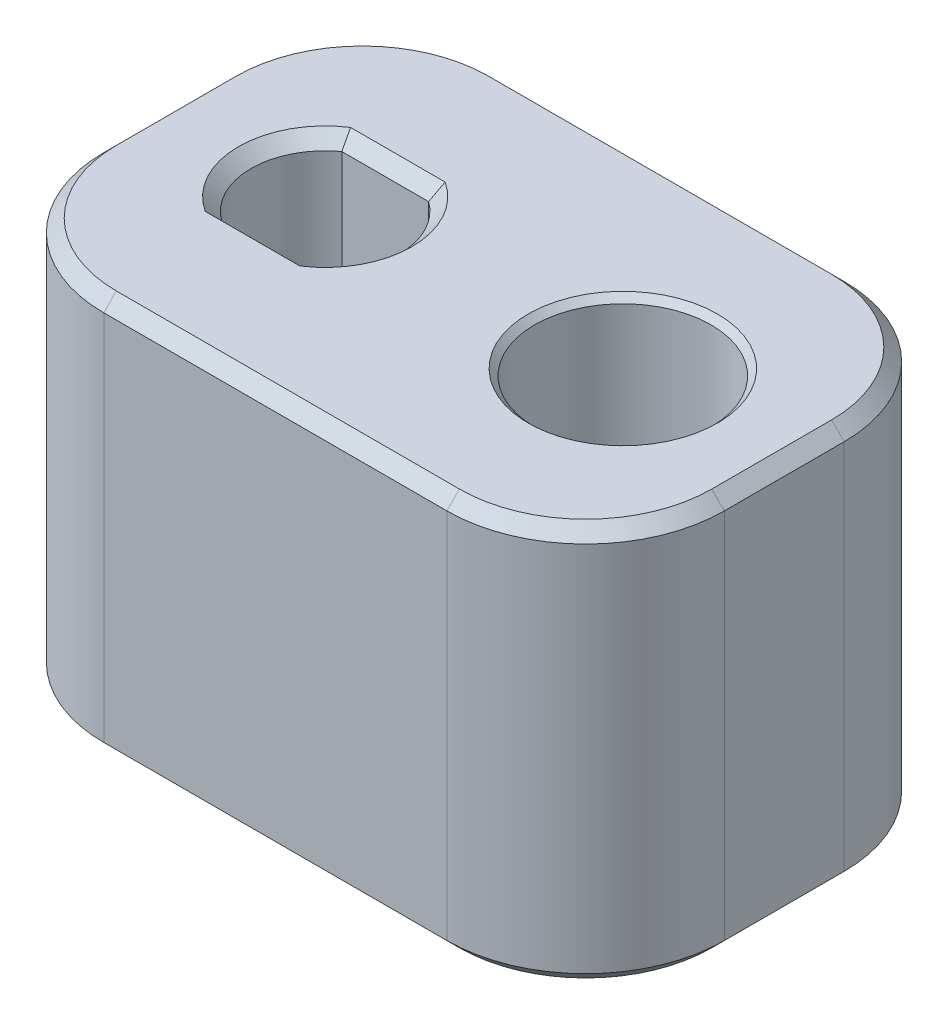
from build123d import *

# Parameters (mm, degrees)
SKETCH1_W      = 24.9936
SKETCH1_H      = 16.002
EXTRUDE1_DEPTH = 16.002
FILLET1_R      = 5.588
EXTRUDE2_DEPTH = 22.823153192
CHAMFER2_SIZE  = 0.508
CHAMFER1_SIZE  = 0.508


with BuildPart() as part:
    # Sketch1 → Extrude1 (new body)
    with BuildSketch(Plane(origin=(0, 0, 0), x_dir=(1, 0, 0), z_dir=(0, 1, 0))):
        Rectangle(SKETCH1_W, SKETCH1_H)
    extrude(amount=EXTRUDE1_DEPTH)

    # Fillet1
    fillet1_edges = [part.edges().sort_by_distance(p)[0] for p in [
        (12.4968, 8.001, 8.001),
        (-12.4968, 8.001, 8.001),
        (-12.4968, 8.001, -8.001),
        (12.4968, 8.001, -8.001),
    ]]
    fillet(fillet1_edges, radius=FILLET1_R)

    # Sketch4 → Extrude2 (cut, through all)
    with BuildSketch(Plane(origin=(0, 16.002, 0), x_dir=(1, 0, 0), z_dir=(0, 1, 0))):
        with BuildLine():
            Line((-7.741965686, 2.41935), (-4.246834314, 2.41935))
            ThreePointArc((-4.246834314, 2.41935), (-3.0099, 0), (-4.246834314, -2.41935))
            Line((-4.246834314, -2.41935), (-7.741965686, -2.41935))
            ThreePointArc((-7.741965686, -2.41935), (-8.9789, 0), (-7.741965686, 2.41935))
        make_face()
    extrude(amount=-EXTRUDE2_DEPTH, mode=Mode.SUBTRACT)

    # Chamfer2
    chamfer2_edges = [part.edges().sort_by_distance(p)[0] for p in [
        (-8.9789, 0, 0),
        (-5.9944, 0, -2.41935),
        (-3.0099, 0, 0),
        (-5.9944, 0, 2.41935),
        (-8.9789, 16.002, 0),
        (-5.9944, 16.002, 2.41935),
        (-3.0099, 16.002, 0),
        (-5.9944, 16.002, -2.41935),
    ]]
    chamfer(chamfer2_edges, length=CHAMFER2_SIZE)

    # Sketch3 → Cut-Revolve2 (revolve, cut)
    with BuildSketch(Plane.XY, mode=Mode.PRIVATE) as cut_revolve2_sk:
        Polygon((5.9944, 16.002), (2.1844, 16.002), (2.4384, 15.748), (2.4384, 7.112), (0.8382, 7.112), (0.8382, 0.508), (0.3302, 0), (5.9944, 0), align=None)
    revolve(cut_revolve2_sk.sketch.rotate(Axis((5.9944, -4.120405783, 0), (0, 1, 0)), 270), axis=Axis((5.9944, -4.120405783, 0), (0, 1, 0)), mode=Mode.SUBTRACT)

    # Chamfer1
    chamfer1_edges = [part.edges().sort_by_distance(p)[0] for p in [
        (-12.4968, 0, 0),
        (-12.4968, 16.002, 0),
        (12.4968, 0, 0),
        (0, 0, 8.001),
        (0, 0, -8.001),
        (10.860112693, 0, 6.364312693),
        (10.860112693, 0, -6.364312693),
        (-10.860112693, 0, 6.364312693),
        (-10.860112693, 0, -6.364312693),
        (0, 16.002, -8.001),
        (12.4968, 16.002, 0),
        (0, 16.002, 8.001),
        (10.860112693, 16.002, 6.364312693),
        (10.860112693, 16.002, -6.364312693),
        (-10.860112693, 16.002, 6.364312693),
        (-10.860112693, 16.002, -6.364312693),
    ]]
    chamfer(chamfer1_edges, length=CHAMFER1_SIZE)


solid = part.part
